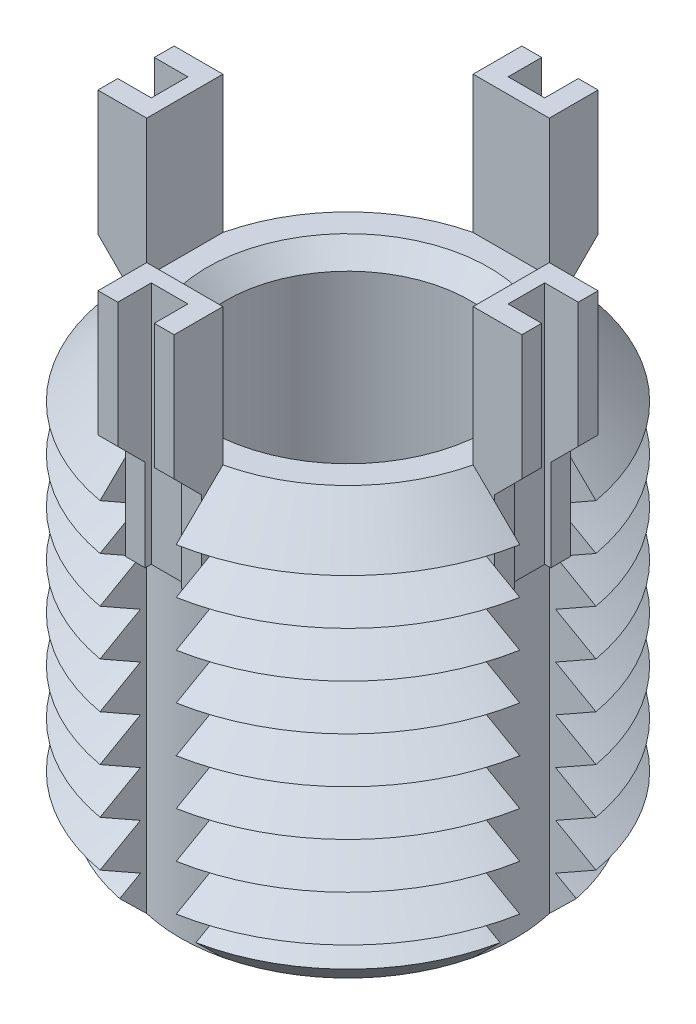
from build123d import *

# Parameters (mm, degrees)
SKETCH1_R               = 7
BOSS_EXTRUDE1_DEPTH     = 14
CHAMFER1_SIZE           = 1.5
LPATTERN1_COUNT         = 8
LPATTERN1_PITCH         = 1.5
CUT_EXTRUDE1_REACH      = 19.146
CIRPATTERN1_COUNT       = 4
BOSS_EXTRUDE3_DEPTH     = 1.25
CIRPATTERN2_COUNT       = 4
CUT_EXTRUDE3_DEPTH      = 21.952896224
CUT_EXTRUDE3_DEPTH_BACK = 21.952896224
SKETCH6_W               = 1.1
SKETCH6_H               = 1.2
SKETCH6_W_2             = 1.2
SKETCH6_H_2             = 1.1
SKETCH7_R               = 4
CUT_EXTRUDE4_DEPTH      = 14
CHAMFER2_SIZE           = 0.625


with BuildPart() as part:
    # Sketch1 → Boss-Extrude1 (new body)
    with BuildSketch(Plane(origin=(0, 0, 0), x_dir=(1, 0, 0), z_dir=(0, 1, 0))):
        with Locations(Location((0, 0, 0), (0, 0, 270))):
            Circle(SKETCH1_R)
    extrude(amount=-BOSS_EXTRUDE1_DEPTH)

    # Chamfer1
    chamfer1_edges = [part.edges().sort_by_distance(p)[0] for p in [
        (0, 0, -7),
        (0, -14, -7),
    ]]
    chamfer(chamfer1_edges, length=CHAMFER1_SIZE)

    # Sketch3 → Cut-Revolve1 (revolve, cut)
    with BuildSketch(Plane(origin=(0, 0, 0), x_dir=(0, 0, -1), z_dir=(1, 0, 0))):
        Polygon((-7, -1.5), (-5.700961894, -2.25), (-7, -3), align=None)
    cut_revolve1 = revolve(axis=Axis((0, 0.885892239, 0), (0, -1, 0)), mode=Mode.SUBTRACT)

    # LPattern1: Cut-Revolve1 ×8
    with Locations(*[(0, -i * LPATTERN1_PITCH, 0) for i in range(1, LPATTERN1_COUNT)]):
        add(cut_revolve1, mode=Mode.SUBTRACT)

    # Cut-Extrude1: up to this cone (the profile starts inside it)
    cut_extrude1_end = Plane(origin=(0, 0, 0), z_dir=(0, 1, 0)).offset(-19.499999) * Cone(1e-06, 58.646, 58.645999, align=(Align.CENTER, Align.CENTER, Align.MIN), mode=Mode.PRIVATE)
    # Sketch4 → Cut-Extrude1 (cut, up to the surface)
    with BuildSketch(Plane(origin=(0, 0, 0), x_dir=(1, 0, 0), z_dir=(0, 1, 0)), mode=Mode.PRIVATE) as cut_extrude1_sk1:
        with BuildLine():
            Line((-5.356071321, 1.25), (-6.887488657, 1.25))
            ThreePointArc((-6.887488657, 1.25), (-7, 0), (-6.887488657, -1.25))
            Line((-6.887488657, -1.25), (-5.356071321, -1.25))
            ThreePointArc((-5.356071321, -1.25), (-5.5, 0), (-5.356071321, 1.25))
        make_face()
    cut_extrude1_tool1 = extrude(cut_extrude1_sk1.sketch, amount=-CUT_EXTRUDE1_REACH, mode=Mode.PRIVATE) & cut_extrude1_end
    cut_extrude1 = cut_extrude1_tool1.solids().sort_by_distance((-6.207212, 0, 0))[0]
    add(cut_extrude1, mode=Mode.SUBTRACT)

    # CirPattern1: Cut-Extrude1 ×4 about axis
    cirpattern1_axis = Axis((0, 0, 0), (0, 1, 0))
    for i in range(1, CIRPATTERN1_COUNT):
        add(cut_extrude1.rotate(cirpattern1_axis, i * 360 / CIRPATTERN1_COUNT), mode=Mode.SUBTRACT)

    # Sketch5 → Boss-Extrude3 (add, symmetric)
    with BuildSketch(Plane(origin=(0, 0, 0), x_dir=(0, 0, -1), z_dir=(1, 0, 0))):
        Polygon((-5.356071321, 4.5), (-5.356071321, -3.5), (-6.056071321, -3.5), (-6.056071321, -0.5), (-6.956071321, 0.4), (-6.956071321, 4.5), align=None)
    boss_extrude3 = extrude(amount=BOSS_EXTRUDE3_DEPTH, both=True)

    # CirPattern2: Boss-Extrude3 ×4 about axis
    cirpattern2_axis = Axis((0, 0, 0), (0, 1, 0))
    for i in range(1, CIRPATTERN2_COUNT):
        add(boss_extrude3.rotate(cirpattern2_axis, i * 360 / CIRPATTERN2_COUNT))

    # Sketch6 → Cut-Extrude3 (cut, two sides: drawn at the far end of the back side and taken through both)
    with BuildSketch(Plane(origin=(0, 4.5, 0), x_dir=(1, 0, 0), z_dir=(0, 1, 0)).offset(-CUT_EXTRUDE3_DEPTH_BACK)):
        with Locations((-6.406071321, 0)):
            Rectangle(SKETCH6_W, SKETCH6_H)
        with Locations((0, 6.406071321)):
            Rectangle(SKETCH6_W_2, SKETCH6_H_2)
        with Locations((6.406071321, 0)):
            Rectangle(SKETCH6_W, SKETCH6_H)
        with Locations((0, -6.406071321)):
            Rectangle(SKETCH6_W_2, SKETCH6_H_2)
    extrude(amount=CUT_EXTRUDE3_DEPTH + CUT_EXTRUDE3_DEPTH_BACK, mode=Mode.SUBTRACT)

    # Sketch7 → Cut-Extrude4 (cut)
    with BuildSketch(Plane(origin=(0, 0, 0), x_dir=(1, 0, 0), z_dir=(0, 1, 0))):
        with Locations(Location((0, 0, 0), (0, 0, 270))):
            Circle(SKETCH7_R)
    extrude(amount=-CUT_EXTRUDE4_DEPTH, mode=Mode.SUBTRACT)

    # Chamfer2
    chamfer2_edges = [part.edges().sort_by_distance(p)[0] for p in [
        (0, 0, -4),
        (0, -14, -4),
    ]]
    chamfer(chamfer2_edges, length=CHAMFER2_SIZE)


solid = part.part
